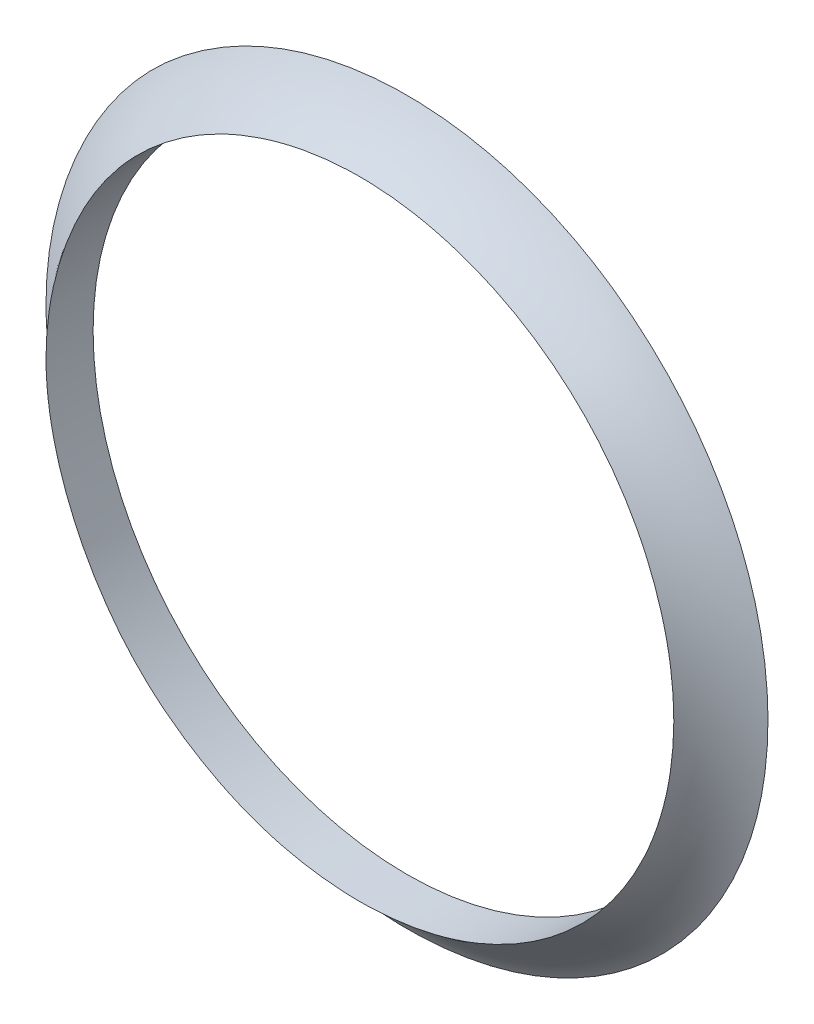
ISO-10303-21;
HEADER;
FILE_DESCRIPTION(('STEP AP214'),'2;1');
FILE_NAME('part.step','',(''),(''),'','','');
FILE_SCHEMA(('AUTOMOTIVE_DESIGN { 1 0 10303 214 1 1 1 1 }'));
ENDSEC;
DATA;
#1=APPLICATION_CONTEXT('core data for automotive mechanical design processes');
#2=APPLICATION_PROTOCOL_DEFINITION('international standard','automotive_design',2000,#1);
#3=PRODUCT_CONTEXT('',#1,'mechanical');
#4=PRODUCT('Part','Part','',(#3));
#5=PRODUCT_RELATED_PRODUCT_CATEGORY('part','',(#4));
#6=PRODUCT_DEFINITION_FORMATION('','',#4);
#7=PRODUCT_DEFINITION_CONTEXT('part definition',#1,'design');
#8=PRODUCT_DEFINITION('design','',#6,#7);
#9=PRODUCT_DEFINITION_SHAPE('','',#8);
#10=(LENGTH_UNIT() NAMED_UNIT(*) SI_UNIT(.MILLI.,.METRE.));
#11=(NAMED_UNIT(*) PLANE_ANGLE_UNIT() SI_UNIT($,.RADIAN.));
#12=(NAMED_UNIT(*) SI_UNIT($,.STERADIAN.) SOLID_ANGLE_UNIT());
#13=UNCERTAINTY_MEASURE_WITH_UNIT(LENGTH_MEASURE(1.E-05),#10,'distance_accuracy_value','');
#14=(GEOMETRIC_REPRESENTATION_CONTEXT(3) GLOBAL_UNCERTAINTY_ASSIGNED_CONTEXT((#13)) GLOBAL_UNIT_ASSIGNED_CONTEXT((#10,
#11,#12)) REPRESENTATION_CONTEXT('',''));
#15=CARTESIAN_POINT('',(0.,0.,0.));
#16=DIRECTION('',(0.,0.,1.));
#17=DIRECTION('',(1.,0.,0.));
#18=AXIS2_PLACEMENT_3D('',#15,#16,#17);
#19=CARTESIAN_POINT('',(274.208529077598,-309.466198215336,-163.999999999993));
#20=DIRECTION('',(0.,0.,1.));
#21=DIRECTION('',(-0.000437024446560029,-0.999999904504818,0.));
#22=AXIS2_PLACEMENT_3D('',#19,#20,#21);
#23=PLANE('',#22);
#24=CARTESIAN_POINT('',(301.151711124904,-439.488037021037,-163.999999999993));
#25=CARTESIAN_POINT('',(301.151703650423,-438.865242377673,-163.999999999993));
#26=CARTESIAN_POINT('',(301.179197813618,-438.242566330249,-163.999999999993));
#27=CARTESIAN_POINT('',(301.28687473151,-437.001589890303,-163.999999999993));
#28=CARTESIAN_POINT('',(301.367074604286,-436.383290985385,-163.999999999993));
#29=CARTESIAN_POINT('',(301.578055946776,-435.154078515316,-163.999999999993));
#30=CARTESIAN_POINT('',(301.70894633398,-434.543183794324,-163.999999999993));
#31=CARTESIAN_POINT('',(302.019060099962,-433.333816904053,-163.999999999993));
#32=CARTESIAN_POINT('',(302.198279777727,-432.735343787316,-163.999999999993));
#33=CARTESIAN_POINT('',(302.535109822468,-431.752433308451,-163.999999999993));
#34=CARTESIAN_POINT('',(302.679816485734,-431.363514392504,-163.999999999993));
#35=CARTESIAN_POINT('',(302.989157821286,-430.593662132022,-163.999999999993));
#36=CARTESIAN_POINT('',(303.153792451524,-430.212728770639,-163.999999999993));
#37=CARTESIAN_POINT('',(303.502498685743,-429.459868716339,-163.999999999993));
#38=CARTESIAN_POINT('',(303.686570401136,-429.087942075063,-163.999999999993));
#39=CARTESIAN_POINT('',(304.073497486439,-428.354520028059,-163.999999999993));
#40=CARTESIAN_POINT('',(304.276331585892,-427.993013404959,-163.999999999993));
#41=CARTESIAN_POINT('',(304.700560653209,-427.281051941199,-163.999999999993));
#42=CARTESIAN_POINT('',(304.921955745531,-426.930597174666,-163.999999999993));
#43=CARTESIAN_POINT('',(305.382957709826,-426.24181842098,-163.999999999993));
#44=CARTESIAN_POINT('',(305.62256652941,-425.90349573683,-163.999999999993));
#45=CARTESIAN_POINT('',(306.139840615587,-425.213220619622,-163.999999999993));
#46=CARTESIAN_POINT('',(306.419016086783,-424.86239830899,-163.999999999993));
#47=CARTESIAN_POINT('',(306.997777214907,-424.17795437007,-163.999999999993));
#48=CARTESIAN_POINT('',(307.297362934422,-423.844332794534,-163.999999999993));
#49=CARTESIAN_POINT('',(307.761612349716,-423.358210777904,-163.999999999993));
#50=CARTESIAN_POINT('',(307.918839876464,-423.198555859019,-163.999999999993));
#51=CARTESIAN_POINT('',(308.238159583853,-422.884187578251,-163.999999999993));
#52=CARTESIAN_POINT('',(308.400251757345,-422.729474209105,-163.999999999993));
#53=CARTESIAN_POINT('',(308.893672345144,-422.272760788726,-163.999999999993));
#54=CARTESIAN_POINT('',(309.232033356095,-421.978304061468,-163.999999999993));
#55=CARTESIAN_POINT('',(309.925855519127,-421.410188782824,-163.999999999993));
#56=CARTESIAN_POINT('',(310.281319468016,-421.136533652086,-163.999999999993));
#57=CARTESIAN_POINT('',(310.825976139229,-420.741972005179,-163.999999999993));
#58=CARTESIAN_POINT('',(311.009445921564,-420.613100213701,-163.999999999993));
#59=CARTESIAN_POINT('',(311.380034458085,-420.36063427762,-163.999999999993));
#60=CARTESIAN_POINT('',(311.567154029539,-420.237041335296,-163.999999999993));
#61=CARTESIAN_POINT('',(312.288617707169,-419.775213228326,-163.999999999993));
#62=CARTESIAN_POINT('',(312.835138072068,-419.455688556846,-163.999999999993));
#63=CARTESIAN_POINT('',(313.952388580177,-418.862296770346,-163.999999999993));
#64=CARTESIAN_POINT('',(314.523120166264,-418.588432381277,-163.999999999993));
#65=CARTESIAN_POINT('',(315.685130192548,-418.08908659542,-163.999999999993));
#66=CARTESIAN_POINT('',(316.276400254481,-417.863585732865,-163.999999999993));
#67=CARTESIAN_POINT('',(317.475923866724,-417.463057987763,-163.999999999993));
#68=CARTESIAN_POINT('',(318.084178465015,-417.288034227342,-163.999999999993));
#69=CARTESIAN_POINT('',(319.01147644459,-417.062840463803,-163.999999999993));
#70=CARTESIAN_POINT('',(319.325997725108,-416.993544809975,-163.999999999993));
#71=CARTESIAN_POINT('',(319.957706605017,-416.868315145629,-163.999999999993));
#72=CARTESIAN_POINT('',(320.274894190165,-416.812381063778,-163.999999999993));
#73=CARTESIAN_POINT('',(320.911319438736,-416.713741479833,-163.999999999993));
#74=CARTESIAN_POINT('',(321.23055715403,-416.671036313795,-163.999999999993));
#75=CARTESIAN_POINT('',(321.870526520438,-416.598841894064,-163.999999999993));
#76=CARTESIAN_POINT('',(322.191258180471,-416.569352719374,-163.999999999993));
#77=CARTESIAN_POINT('',(322.833781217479,-416.523648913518,-163.999999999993));
#78=CARTESIAN_POINT('',(323.155572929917,-416.507438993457,-163.999999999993));
#79=CARTESIAN_POINT('',(323.799550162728,-416.488516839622,-163.999999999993));
#80=CARTESIAN_POINT('',(324.121735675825,-416.485804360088,-163.999999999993));
#81=CARTESIAN_POINT('',(324.765935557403,-416.493986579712,-163.999999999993));
#82=CARTESIAN_POINT('',(325.087949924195,-416.504881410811,-163.999999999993));
#83=CARTESIAN_POINT('',(325.73125448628,-416.540021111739,-163.999999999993));
#84=CARTESIAN_POINT('',(326.052544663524,-416.564266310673,-163.999999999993));
#85=CARTESIAN_POINT('',(326.696978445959,-416.626316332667,-163.999999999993));
#86=CARTESIAN_POINT('',(327.02010954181,-416.664251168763,-163.999999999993));
#87=CARTESIAN_POINT('',(327.664496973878,-416.753613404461,-163.999999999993));
#88=CARTESIAN_POINT('',(327.985753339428,-416.805040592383,-163.999999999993));
#89=CARTESIAN_POINT('',(328.625777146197,-416.921499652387,-163.999999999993));
#90=CARTESIAN_POINT('',(328.944544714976,-416.98653082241,-163.999999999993));
#91=CARTESIAN_POINT('',(329.57898652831,-417.130274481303,-163.999999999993));
#92=CARTESIAN_POINT('',(329.894660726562,-417.208987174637,-163.999999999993));
#93=CARTESIAN_POINT('',(330.522212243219,-417.379937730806,-163.999999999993));
#94=CARTESIAN_POINT('',(330.834090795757,-417.472171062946,-163.999999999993));
#95=CARTESIAN_POINT('',(331.453581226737,-417.669998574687,-163.999999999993));
#96=CARTESIAN_POINT('',(331.761193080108,-417.77559283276,-163.999999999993));
#97=CARTESIAN_POINT('',(332.371585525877,-417.999874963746,-163.999999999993));
#98=CARTESIAN_POINT('',(332.67436645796,-418.118561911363,-163.999999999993));
#99=CARTESIAN_POINT('',(333.274668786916,-418.368710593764,-163.999999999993));
#100=CARTESIAN_POINT('',(333.572188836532,-418.500175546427,-163.999999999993));
#101=CARTESIAN_POINT('',(334.448983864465,-418.910037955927,-163.999999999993));
#102=CARTESIAN_POINT('',(335.019885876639,-419.206627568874,-163.999999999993));
#103=CARTESIAN_POINT('',(336.134835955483,-419.846446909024,-163.999999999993));
#104=CARTESIAN_POINT('',(336.67888373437,-420.189677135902,-163.999999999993));
#105=CARTESIAN_POINT('',(337.736528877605,-420.920580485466,-163.999999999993));
#106=CARTESIAN_POINT('',(338.250116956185,-421.308267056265,-163.999999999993));
#107=CARTESIAN_POINT('',(339.243217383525,-422.125090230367,-163.999999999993));
#108=CARTESIAN_POINT('',(339.722728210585,-422.554228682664,-163.999999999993));
#109=CARTESIAN_POINT('',(340.648626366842,-423.454866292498,-163.999999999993));
#110=CARTESIAN_POINT('',(341.094676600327,-423.926712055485,-163.999999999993));
#111=CARTESIAN_POINT('',(341.94559222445,-424.90617271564,-163.999999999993));
#112=CARTESIAN_POINT('',(342.350458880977,-425.413786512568,-163.999999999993));
#113=CARTESIAN_POINT('',(343.115801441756,-426.461193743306,-163.999999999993));
#114=CARTESIAN_POINT('',(343.476290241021,-427.000977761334,-163.999999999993));
#115=CARTESIAN_POINT('',(344.150487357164,-428.109147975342,-163.999999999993));
#116=CARTESIAN_POINT('',(344.464193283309,-428.677535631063,-163.999999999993));
#117=CARTESIAN_POINT('',(344.898076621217,-429.548664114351,-163.999999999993));
#118=CARTESIAN_POINT('',(345.036684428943,-429.842364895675,-163.999999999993));
#119=CARTESIAN_POINT('',(345.301358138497,-430.43538322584,-163.999999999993));
#120=CARTESIAN_POINT('',(345.427424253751,-430.734700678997,-163.999999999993));
#121=CARTESIAN_POINT('',(345.666682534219,-431.338410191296,-163.999999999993));
#122=CARTESIAN_POINT('',(345.779875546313,-431.642801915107,-163.999999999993));
#123=CARTESIAN_POINT('',(345.993084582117,-432.256169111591,-163.999999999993));
#124=CARTESIAN_POINT('',(346.093100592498,-432.565144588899,-163.999999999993));
#125=CARTESIAN_POINT('',(346.279740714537,-433.187172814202,-163.999999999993));
#126=CARTESIAN_POINT('',(346.366362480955,-433.500226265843,-163.999999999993));
#127=CARTESIAN_POINT('',(346.526046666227,-434.129810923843,-163.999999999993));
#128=CARTESIAN_POINT('',(346.59910752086,-434.446342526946,-163.999999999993));
#129=CARTESIAN_POINT('',(346.731585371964,-435.082263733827,-163.999999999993));
#130=CARTESIAN_POINT('',(346.791001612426,-435.401653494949,-163.999999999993));
#131=CARTESIAN_POINT('',(346.896327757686,-436.042614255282,-163.999999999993));
#132=CARTESIAN_POINT('',(346.942239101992,-436.364185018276,-163.999999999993));
#133=CARTESIAN_POINT('',(347.020153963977,-437.005182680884,-163.999999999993));
#134=CARTESIAN_POINT('',(347.052314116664,-437.324590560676,-163.999999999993));
#135=CARTESIAN_POINT('',(347.103450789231,-437.964455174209,-163.999999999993));
#136=CARTESIAN_POINT('',(347.122427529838,-438.284911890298,-163.999999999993));
#137=CARTESIAN_POINT('',(347.147047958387,-438.926336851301,-163.999999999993));
#138=CARTESIAN_POINT('',(347.152691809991,-439.247305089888,-163.999999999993));
#139=CARTESIAN_POINT('',(347.150448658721,-439.88919259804,-163.999999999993));
#140=CARTESIAN_POINT('',(347.142561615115,-440.210111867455,-163.999999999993));
#141=CARTESIAN_POINT('',(347.113498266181,-440.851302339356,-163.999999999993));
#142=CARTESIAN_POINT('',(347.092324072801,-441.171573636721,-163.999999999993));
#143=CARTESIAN_POINT('',(347.036811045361,-441.810944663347,-163.999999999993));
#144=CARTESIAN_POINT('',(347.002472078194,-442.13004438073,-163.999999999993));
#145=CARTESIAN_POINT('',(346.879764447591,-443.084840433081,-163.999999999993));
#146=CARTESIAN_POINT('',(346.771698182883,-443.718184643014,-163.999999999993));
#147=CARTESIAN_POINT('',(346.56862796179,-444.664393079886,-163.999999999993));
#148=CARTESIAN_POINT('',(346.493348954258,-444.981647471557,-163.999999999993));
#149=CARTESIAN_POINT('',(346.329138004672,-445.6125954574,-163.999999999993));
#150=CARTESIAN_POINT('',(346.240207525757,-445.926289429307,-163.999999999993));
#151=CARTESIAN_POINT('',(346.048853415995,-446.549560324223,-163.999999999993));
#152=CARTESIAN_POINT('',(345.946428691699,-446.859136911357,-163.999999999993));
#153=CARTESIAN_POINT('',(345.728342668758,-447.473569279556,-163.999999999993));
#154=CARTESIAN_POINT('',(345.612681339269,-447.778425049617,-163.999999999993));
#155=CARTESIAN_POINT('',(345.246346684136,-448.685146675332,-163.999999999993));
#156=CARTESIAN_POINT('',(344.97627871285,-449.27930965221,-163.999999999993));
#157=CARTESIAN_POINT('',(344.386802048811,-450.442522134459,-163.999999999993));
#158=CARTESIAN_POINT('',(344.067393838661,-451.011571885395,-163.999999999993));
#159=CARTESIAN_POINT('',(343.386808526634,-452.111844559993,-163.999999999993));
#160=CARTESIAN_POINT('',(343.026364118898,-452.643520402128,-163.999999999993));
#161=CARTESIAN_POINT('',(342.26237907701,-453.67493011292,-163.999999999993));
#162=CARTESIAN_POINT('',(341.858838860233,-454.174664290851,-163.999999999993));
#163=CARTESIAN_POINT('',(341.011619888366,-455.138964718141,-163.999999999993));
#164=CARTESIAN_POINT('',(340.567936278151,-455.603526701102,-163.999999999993));
#165=CARTESIAN_POINT('',(339.643599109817,-456.494281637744,-163.999999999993));
#166=CARTESIAN_POINT('',(339.162945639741,-456.920474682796,-163.999999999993));
#167=CARTESIAN_POINT('',(338.161360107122,-457.736674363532,-163.999999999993));
#168=CARTESIAN_POINT('',(337.639985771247,-458.126138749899,-163.999999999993));
#169=CARTESIAN_POINT('',(336.566138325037,-458.859535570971,-163.999999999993));
#170=CARTESIAN_POINT('',(336.013663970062,-459.203466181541,-163.999999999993));
#171=CARTESIAN_POINT('',(334.88166943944,-459.843345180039,-163.999999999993));
#172=CARTESIAN_POINT('',(334.302155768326,-460.139305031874,-163.999999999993));
#173=CARTESIAN_POINT('',(333.415849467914,-460.545603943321,-163.999999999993));
#174=CARTESIAN_POINT('',(333.11755071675,-460.674772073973,-163.999999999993));
#175=CARTESIAN_POINT('',(332.51570200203,-460.92031817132,-163.999999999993));
#176=CARTESIAN_POINT('',(332.21215193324,-461.036695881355,-163.999999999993));
#177=CARTESIAN_POINT('',(331.601813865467,-461.255779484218,-163.999999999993));
#178=CARTESIAN_POINT('',(331.295048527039,-461.358548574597,-163.999999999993));
#179=CARTESIAN_POINT('',(330.677418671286,-461.550820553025,-163.999999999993));
#180=CARTESIAN_POINT('',(330.366554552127,-461.640324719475,-163.999999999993));
#181=CARTESIAN_POINT('',(329.741244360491,-461.805916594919,-163.999999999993));
#182=CARTESIAN_POINT('',(329.426797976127,-461.882003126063,-163.999999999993));
#183=CARTESIAN_POINT('',(328.79493617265,-462.020640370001,-163.999999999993));
#184=CARTESIAN_POINT('',(328.477520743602,-462.083191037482,-163.999999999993));
#185=CARTESIAN_POINT('',(327.840285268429,-462.194873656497,-163.999999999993));
#186=CARTESIAN_POINT('',(327.520464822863,-462.244003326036,-163.999999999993));
#187=CARTESIAN_POINT('',(326.879057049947,-462.328919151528,-163.999999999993));
#188=CARTESIAN_POINT('',(326.557469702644,-462.364705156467,-163.999999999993));
#189=CARTESIAN_POINT('',(325.913083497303,-462.422896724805,-163.999999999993));
#190=CARTESIAN_POINT('',(325.590284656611,-462.445302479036,-163.999999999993));
#191=CARTESIAN_POINT('',(324.944066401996,-462.476623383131,-163.999999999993));
#192=CARTESIAN_POINT('',(324.620647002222,-462.48553883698,-163.999999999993));
#193=CARTESIAN_POINT('',(323.652302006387,-462.491643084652,-163.999999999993));
#194=CARTESIAN_POINT('',(323.007084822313,-462.468391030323,-163.999999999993));
#195=CARTESIAN_POINT('',(322.042624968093,-462.39361812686,-163.999999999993));
#196=CARTESIAN_POINT('',(321.721657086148,-462.362037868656,-163.999999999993));
#197=CARTESIAN_POINT('',(321.081272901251,-462.285627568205,-163.999999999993));
#198=CARTESIAN_POINT('',(320.761856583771,-462.240797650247,-163.999999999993));
#199=CARTESIAN_POINT('',(320.125169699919,-462.137855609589,-163.999999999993));
#200=CARTESIAN_POINT('',(319.80789918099,-462.079743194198,-163.999999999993));
#201=CARTESIAN_POINT('',(319.176105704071,-461.950091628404,-163.999999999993));
#202=CARTESIAN_POINT('',(318.86158277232,-461.878552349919,-163.999999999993));
#203=CARTESIAN_POINT('',(318.235927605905,-461.722091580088,-163.999999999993));
#204=CARTESIAN_POINT('',(317.924794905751,-461.637171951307,-163.999999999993));
#205=CARTESIAN_POINT('',(317.306454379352,-461.454067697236,-163.999999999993));
#206=CARTESIAN_POINT('',(316.99924667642,-461.355882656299,-163.999999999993));
#207=CARTESIAN_POINT('',(316.28727626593,-461.11139818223,-163.999999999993));
#208=CARTESIAN_POINT('',(315.884256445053,-460.959990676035,-163.999999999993));
#209=CARTESIAN_POINT('',(315.087426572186,-460.634556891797,-163.999999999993));
#210=CARTESIAN_POINT('',(314.69361744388,-460.460528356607,-163.999999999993));
#211=CARTESIAN_POINT('',(313.916330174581,-460.090673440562,-163.999999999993));
#212=CARTESIAN_POINT('',(313.532853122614,-459.894844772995,-163.999999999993));
#213=CARTESIAN_POINT('',(312.777456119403,-459.482286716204,-163.999999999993));
#214=CARTESIAN_POINT('',(312.405532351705,-459.265564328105,-163.999999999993));
#215=CARTESIAN_POINT('',(311.857061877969,-458.925415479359,-163.999999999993));
#216=CARTESIAN_POINT('',(311.675804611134,-458.809519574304,-163.999999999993));
#217=CARTESIAN_POINT('',(311.316531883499,-458.572807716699,-163.999999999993));
#218=CARTESIAN_POINT('',(311.138516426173,-458.451991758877,-163.999999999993));
#219=CARTESIAN_POINT('',(310.609609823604,-458.082231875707,-163.999999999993));
#220=CARTESIAN_POINT('',(310.263806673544,-457.825943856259,-163.999999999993));
#221=CARTESIAN_POINT('',(309.58514569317,-457.292278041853,-163.999999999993));
#222=CARTESIAN_POINT('',(309.252389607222,-457.014770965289,-163.999999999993));
#223=CARTESIAN_POINT('',(308.603760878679,-456.440667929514,-163.999999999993));
#224=CARTESIAN_POINT('',(308.287887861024,-456.14407239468,-163.999999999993));
#225=CARTESIAN_POINT('',(307.674483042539,-455.532518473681,-163.999999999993));
#226=CARTESIAN_POINT('',(307.376950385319,-455.217560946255,-163.999999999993));
#227=CARTESIAN_POINT('',(306.800675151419,-454.570783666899,-163.999999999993));
#228=CARTESIAN_POINT('',(306.521937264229,-454.238959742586,-163.999999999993));
#229=CARTESIAN_POINT('',(305.983710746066,-453.559994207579,-163.999999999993));
#230=CARTESIAN_POINT('',(305.724224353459,-453.212850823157,-163.999999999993));
#231=CARTESIAN_POINT('',(305.224959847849,-452.504696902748,-163.999999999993));
#232=CARTESIAN_POINT('',(304.985182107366,-452.143686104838,-163.999999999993));
#233=CARTESIAN_POINT('',(304.419866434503,-451.239803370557,-163.999999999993));
#234=CARTESIAN_POINT('',(304.105704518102,-450.689764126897,-163.999999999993));
#235=CARTESIAN_POINT('',(303.521742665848,-449.566711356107,-163.999999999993));
#236=CARTESIAN_POINT('',(303.251941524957,-448.993698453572,-163.999999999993));
#237=CARTESIAN_POINT('',(302.758387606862,-447.828477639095,-163.999999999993));
#238=CARTESIAN_POINT('',(302.534611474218,-447.236279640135,-163.999999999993));
#239=CARTESIAN_POINT('',(302.134874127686,-446.036138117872,-163.999999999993));
#240=CARTESIAN_POINT('',(301.958903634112,-445.42819767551,-163.999999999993));
#241=CARTESIAN_POINT('',(301.593670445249,-443.943167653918,-163.999999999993));
#242=CARTESIAN_POINT('',(301.429568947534,-443.059743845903,-163.999999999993));
#243=CARTESIAN_POINT('',(301.208645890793,-441.280135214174,-163.999999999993));
#244=CARTESIAN_POINT('',(301.15172187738,-440.383963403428,-163.999999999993));
#245=CARTESIAN_POINT('',(301.151711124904,-439.488037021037,-163.999999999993));
#246=B_SPLINE_CURVE_WITH_KNOTS('',3,(#24,#25,#26,#27,#28,#29,#30,#31,#32,#33,#34,#35,#36,#37,
#38,#39,#40,#41,#42,#43,#44,#45,#46,#47,#48,#49,#50,#51,#52,#53,#54,#55,#56,#57,#58,#59,#60,#61,
#62,#63,#64,#65,#66,#67,#68,#69,#70,#71,#72,#73,#74,#75,#76,#77,#78,#79,#80,#81,#82,#83,#84,#85,
#86,#87,#88,#89,#90,#91,#92,#93,#94,#95,#96,#97,#98,#99,#100,#101,#102,#103,#104,#105,#106,#107,
#108,#109,#110,#111,#112,#113,#114,#115,#116,#117,#118,#119,#120,#121,#122,#123,#124,#125,#126,
#127,#128,#129,#130,#131,#132,#133,#134,#135,#136,#137,#138,#139,#140,#141,#142,#143,#144,#145,
#146,#147,#148,#149,#150,#151,#152,#153,#154,#155,#156,#157,#158,#159,#160,#161,#162,#163,#164,
#165,#166,#167,#168,#169,#170,#171,#172,#173,#174,#175,#176,#177,#178,#179,#180,#181,#182,#183,
#184,#185,#186,#187,#188,#189,#190,#191,#192,#193,#194,#195,#196,#197,#198,#199,#200,#201,#202,
#203,#204,#205,#206,#207,#208,#209,#210,#211,#212,#213,#214,#215,#216,#217,#218,#219,#220,#221,
#222,#223,#224,#225,#226,#227,#228,#229,#230,#231,#232,#233,#234,#235,#236,#237,#238,#239,#240,
#241,#242,#243,#244,#245),.UNSPECIFIED.,.T.,.F.,(4,2,2,2,2,2,2,2,2,2,2,2,2,2,2,2,2,2,2,2,2,2,2,
2,2,2,2,2,2,2,2,2,2,2,2,2,2,2,2,2,2,2,2,2,2,2,2,2,2,2,2,2,2,2,2,2,2,2,2,2,2,2,2,2,2,2,2,2,2,2,2,
2,2,2,2,2,2,2,2,2,2,2,2,2,2,2,2,2,2,2,2,2,2,2,2,2,2,2,2,2,2,2,2,2,2,2,2,2,2,2,4),(0.,
1.86762920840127,3.73586529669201,5.60813809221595,7.48026755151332,8.72466558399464,
9.96906099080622,11.21346353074,12.4564722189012,13.6994892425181,14.9426393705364,
16.2869180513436,17.6312008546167,18.3033361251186,18.9754704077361,20.3202221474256,
21.6651945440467,22.337733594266,23.010425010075,24.9073292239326,26.8043466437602,
28.7005990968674,30.5969688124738,31.5629220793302,32.528870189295,33.4948428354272,
34.4608212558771,35.4271422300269,36.3934456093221,37.3597583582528,38.3260949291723,
39.3018615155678,40.277612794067,41.2533137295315,42.2290292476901,43.2044185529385,
44.1798135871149,45.1551397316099,46.1307121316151,48.058297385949,49.9859032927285,
51.9140938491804,53.8423704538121,55.7880081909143,57.7335861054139,59.6785973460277,
61.6237079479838,62.5977653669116,63.5718062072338,64.5457829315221,65.519760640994,
66.4939086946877,67.4681690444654,68.4424833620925,69.4166937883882,70.3794909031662,
71.3422718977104,72.3050410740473,73.2678131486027,74.2304322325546,75.1930610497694,
77.1178665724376,78.0958194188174,79.0736675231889,80.0515949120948,81.0295245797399,
82.9849371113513,84.9403305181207,86.8650925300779,88.7898359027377,90.7148123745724,
92.6397842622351,94.5897726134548,96.5398390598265,98.4894387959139,99.464391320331,
100.439363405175,101.409635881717,102.379814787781,103.350078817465,104.320346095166,
105.290778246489,106.261221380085,107.231650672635,108.202058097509,110.136251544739,
111.103604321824,112.070948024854,113.03831304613,114.005687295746,114.972927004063,
115.940197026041,117.231032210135,118.521996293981,119.813095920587,121.103764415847,
121.749120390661,122.394477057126,123.685007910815,124.984147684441,126.283258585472,
127.582308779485,128.88168190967,130.181205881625,131.480754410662,133.378949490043,
135.277092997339,137.174270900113,139.071080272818,141.760345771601,144.447039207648),.UNSPECIFIED.);
#247=CARTESIAN_POINT('',(301.151711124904,-439.488037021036,-163.999999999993));
#248=VERTEX_POINT('',#247);
#249=EDGE_CURVE('E61',#248,#248,#246,.T.);
#250=ORIENTED_EDGE('',*,*,#249,.T.);
#251=EDGE_LOOP('',(#250));
#252=FACE_BOUND('',#251,.T.);
#253=CARTESIAN_POINT('',(324.151711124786,-439.488037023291,-163.999999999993));
#254=DIRECTION('',(0.,0.,1.));
#255=DIRECTION('',(-0.000437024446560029,-0.999999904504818,0.));
#256=AXIS2_PLACEMENT_3D('',#253,#254,#255);
#257=CIRCLE('',#256,20.);
#258=CARTESIAN_POINT('',(324.142970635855,-459.488035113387,-163.999999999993));
#259=VERTEX_POINT('',#258);
#260=EDGE_CURVE('E71',#259,#259,#257,.T.);
#261=ORIENTED_EDGE('',*,*,#260,.T.);
#262=EDGE_LOOP('',(#261));
#263=FACE_BOUND('',#262,.T.);
#264=ADVANCED_FACE('F54',(#252,#263),#23,.F.);
#265=CARTESIAN_POINT('',(324.15171112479,-439.48803702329,-152.499999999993));
#266=DIRECTION('',(0.,0.,-1.));
#267=DIRECTION('',(0.000437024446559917,0.999999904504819,0.));
#268=AXIS2_PLACEMENT_3D('',#265,#266,#267);
#269=CYLINDRICAL_SURFACE('',#268,20.);
#270=CARTESIAN_POINT('',(304.15171112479,-439.488037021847,-160.999999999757));
#271=CARTESIAN_POINT('',(304.15171486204,-440.048969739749,-160.999998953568));
#272=CARTESIAN_POINT('',(304.175330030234,-440.610006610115,-161.003315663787));
#273=CARTESIAN_POINT('',(304.269639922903,-441.728176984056,-161.013238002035));
#274=CARTESIAN_POINT('',(304.340347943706,-442.285309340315,-161.019844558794));
#275=CARTESIAN_POINT('',(304.528447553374,-443.392272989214,-161.033482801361));
#276=CARTESIAN_POINT('',(304.645891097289,-443.942095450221,-161.040514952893));
#277=CARTESIAN_POINT('',(304.926651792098,-445.029926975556,-161.052818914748));
#278=CARTESIAN_POINT('',(305.089965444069,-445.567936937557,-161.058090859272));
#279=CARTESIAN_POINT('',(305.399410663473,-446.45163358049,-161.064283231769));
#280=CARTESIAN_POINT('',(305.533155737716,-446.80170735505,-161.066068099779));
#281=CARTESIAN_POINT('',(305.820108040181,-447.493824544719,-161.068065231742));
#282=CARTESIAN_POINT('',(305.973315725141,-447.835867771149,-161.068277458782));
#283=CARTESIAN_POINT('',(306.298696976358,-448.510799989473,-161.067093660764));
#284=CARTESIAN_POINT('',(306.470870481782,-448.843689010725,-161.065697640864));
#285=CARTESIAN_POINT('',(306.833599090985,-449.499194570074,-161.06144087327));
#286=CARTESIAN_POINT('',(307.024150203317,-449.821813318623,-161.058580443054));
#287=CARTESIAN_POINT('',(307.423061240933,-450.455833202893,-161.051716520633));
#288=CARTESIAN_POINT('',(307.631421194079,-450.767234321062,-161.047713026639));
#289=CARTESIAN_POINT('',(308.06529368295,-451.377841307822,-161.039071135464));
#290=CARTESIAN_POINT('',(308.290806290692,-451.6770471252,-161.034432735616));
#291=CARTESIAN_POINT('',(308.758083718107,-452.262083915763,-161.025225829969));
#292=CARTESIAN_POINT('',(308.999834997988,-452.547925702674,-161.020657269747));
#293=CARTESIAN_POINT('',(309.49899959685,-453.105602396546,-161.01247492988));
#294=CARTESIAN_POINT('',(309.756412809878,-453.377437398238,-161.008861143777));
#295=CARTESIAN_POINT('',(310.286094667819,-453.906245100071,-161.003670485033));
#296=CARTESIAN_POINT('',(310.558363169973,-454.163217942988,-161.00209359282));
#297=CARTESIAN_POINT('',(311.116893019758,-454.661487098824,-161.000429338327));
#298=CARTESIAN_POINT('',(311.403154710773,-454.902783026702,-161.000342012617));
#299=CARTESIAN_POINT('',(311.988785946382,-455.368947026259,-161.000853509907));
#300=CARTESIAN_POINT('',(312.288155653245,-455.593814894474,-161.001452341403));
#301=CARTESIAN_POINT('',(312.74628283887,-455.91822974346,-161.002099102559));
#302=CARTESIAN_POINT('',(312.900510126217,-456.0242240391,-161.00227277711));
#303=CARTESIAN_POINT('',(313.211880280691,-456.231845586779,-161.002417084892));
#304=CARTESIAN_POINT('',(313.369023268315,-456.333472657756,-161.002387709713));
#305=CARTESIAN_POINT('',(314.003538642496,-456.731298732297,-161.001923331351));
#306=CARTESIAN_POINT('',(314.492226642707,-457.009740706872,-161.000794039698));
#307=CARTESIAN_POINT('',(315.491289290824,-457.524469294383,-160.997886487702));
#308=CARTESIAN_POINT('',(316.001663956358,-457.760755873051,-160.99610822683));
#309=CARTESIAN_POINT('',(316.780672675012,-458.082304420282,-160.993989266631));
#310=CARTESIAN_POINT('',(317.042613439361,-458.184016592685,-160.993374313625));
#311=CARTESIAN_POINT('',(317.570547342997,-458.376319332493,-160.992469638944));
#312=CARTESIAN_POINT('',(317.836540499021,-458.466909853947,-160.992179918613));
#313=CARTESIAN_POINT('',(318.639862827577,-458.721732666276,-160.991914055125));
#314=CARTESIAN_POINT('',(319.1826513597,-458.869064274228,-160.992540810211));
#315=CARTESIAN_POINT('',(320.279033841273,-459.117568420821,-160.99499676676));
#316=CARTESIAN_POINT('',(320.832634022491,-459.2187134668,-160.99682668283));
#317=CARTESIAN_POINT('',(321.667815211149,-459.335186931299,-160.998724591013));
#318=CARTESIAN_POINT('',(321.947037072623,-459.368139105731,-160.999216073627));
#319=CARTESIAN_POINT('',(322.506639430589,-459.422247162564,-160.999874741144));
#320=CARTESIAN_POINT('',(322.787019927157,-459.443403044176,-161.000041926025));
#321=CARTESIAN_POINT('',(323.348418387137,-459.47387586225,-161.000130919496));
#322=CARTESIAN_POINT('',(323.62943634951,-459.48319281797,-161.000052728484));
#323=CARTESIAN_POINT('',(324.191616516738,-459.489972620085,-161.00000100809));
#324=CARTESIAN_POINT('',(324.472778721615,-459.487435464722,-161.000027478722));
#325=CARTESIAN_POINT('',(325.034746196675,-459.470511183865,-161.000030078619));
#326=CARTESIAN_POINT('',(325.315551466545,-459.456124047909,-161.000006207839));
#327=CARTESIAN_POINT('',(325.876305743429,-459.41552548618,-160.999667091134));
#328=CARTESIAN_POINT('',(326.156254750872,-459.389314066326,-160.999351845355));
#329=CARTESIAN_POINT('',(326.714809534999,-459.325112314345,-160.998418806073));
#330=CARTESIAN_POINT('',(326.993415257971,-459.287121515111,-160.997801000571));
#331=CARTESIAN_POINT('',(327.54877721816,-459.199428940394,-160.996398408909));
#332=CARTESIAN_POINT('',(327.825533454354,-459.149727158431,-160.995613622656));
#333=CARTESIAN_POINT('',(328.37670476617,-459.038700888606,-160.994240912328));
#334=CARTESIAN_POINT('',(328.651119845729,-458.977376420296,-160.993652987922));
#335=CARTESIAN_POINT('',(329.197121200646,-458.843213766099,-160.992813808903));
#336=CARTESIAN_POINT('',(329.46870747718,-458.770375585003,-160.99256255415));
#337=CARTESIAN_POINT('',(330.008568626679,-458.613314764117,-160.992411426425));
#338=CARTESIAN_POINT('',(330.276843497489,-458.52909211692,-160.992511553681));
#339=CARTESIAN_POINT('',(330.809602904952,-458.349413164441,-160.993014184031));
#340=CARTESIAN_POINT('',(331.074087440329,-458.253956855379,-160.993416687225));
#341=CARTESIAN_POINT('',(331.598801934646,-458.051976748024,-160.994384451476));
#342=CARTESIAN_POINT('',(331.859031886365,-457.945452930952,-160.994949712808));
#343=CARTESIAN_POINT('',(332.374753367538,-457.721540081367,-160.996079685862));
#344=CARTESIAN_POINT('',(332.630244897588,-457.604151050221,-160.996644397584));
#345=CARTESIAN_POINT('',(333.38893819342,-457.235980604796,-160.998304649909));
#346=CARTESIAN_POINT('',(333.884473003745,-456.969151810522,-160.999366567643));
#347=CARTESIAN_POINT('',(334.851235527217,-456.394735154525,-161.001365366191));
#348=CARTESIAN_POINT('',(335.322463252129,-456.087147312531,-161.002302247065));
#349=CARTESIAN_POINT('',(336.237351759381,-455.433360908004,-161.004074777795));
#350=CARTESIAN_POINT('',(336.681012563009,-455.087162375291,-161.004910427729));
#351=CARTESIAN_POINT('',(337.537590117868,-454.358624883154,-161.006077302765));
#352=CARTESIAN_POINT('',(337.950506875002,-453.976285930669,-161.006408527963));
#353=CARTESIAN_POINT('',(338.742683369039,-453.178167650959,-161.006349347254));
#354=CARTESIAN_POINT('',(339.121941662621,-452.762386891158,-161.005958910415));
#355=CARTESIAN_POINT('',(339.844085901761,-451.900349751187,-161.004707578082));
#356=CARTESIAN_POINT('',(340.186971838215,-451.45409336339,-161.003846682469));
#357=CARTESIAN_POINT('',(340.833924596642,-450.534300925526,-161.002047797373));
#358=CARTESIAN_POINT('',(341.137991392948,-450.060764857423,-161.001109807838));
#359=CARTESIAN_POINT('',(341.705181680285,-449.089689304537,-160.999095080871));
#360=CARTESIAN_POINT('',(341.968305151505,-448.59214980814,-160.998018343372));
#361=CARTESIAN_POINT('',(342.330801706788,-447.830686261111,-160.996344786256));
#362=CARTESIAN_POINT('',(342.446280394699,-447.57430940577,-160.995777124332));
#363=CARTESIAN_POINT('',(342.666336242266,-447.056898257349,-160.994655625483));
#364=CARTESIAN_POINT('',(342.77091340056,-446.795863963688,-160.994101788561));
#365=CARTESIAN_POINT('',(342.968967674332,-446.269622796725,-160.993191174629));
#366=CARTESIAN_POINT('',(343.062444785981,-446.004415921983,-160.992834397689));
#367=CARTESIAN_POINT('',(343.238135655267,-445.470296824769,-160.992438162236));
#368=CARTESIAN_POINT('',(343.320349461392,-445.201384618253,-160.992398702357));
#369=CARTESIAN_POINT('',(343.473367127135,-444.660333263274,-160.992672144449));
#370=CARTESIAN_POINT('',(343.544170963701,-444.388194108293,-160.992985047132));
#371=CARTESIAN_POINT('',(343.674242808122,-443.841173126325,-160.993945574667));
#372=CARTESIAN_POINT('',(343.733510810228,-443.566291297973,-160.994593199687));
#373=CARTESIAN_POINT('',(343.840405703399,-443.014273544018,-160.996023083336));
#374=CARTESIAN_POINT('',(343.888032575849,-442.737137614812,-160.996805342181));
#375=CARTESIAN_POINT('',(343.97156053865,-442.181103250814,-160.998161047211));
#376=CARTESIAN_POINT('',(344.007461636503,-441.90220481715,-160.99873449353));
#377=CARTESIAN_POINT('',(344.067472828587,-441.343156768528,-160.999565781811));
#378=CARTESIAN_POINT('',(344.091583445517,-441.063007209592,-160.999823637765));
#379=CARTESIAN_POINT('',(344.127973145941,-440.501931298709,-161.00007416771));
#380=CARTESIAN_POINT('',(344.140252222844,-440.221004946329,-161.000066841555));
#381=CARTESIAN_POINT('',(344.149780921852,-439.799432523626,-161.000022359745));
#382=CARTESIAN_POINT('',(344.151475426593,-439.658874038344,-161.000001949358));
#383=CARTESIAN_POINT('',(344.15190099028,-439.377752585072,-160.999998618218));
#384=CARTESIAN_POINT('',(344.150632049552,-439.237189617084,-161.00001569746));
#385=CARTESIAN_POINT('',(344.142379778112,-438.815590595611,-161.000060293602));
#386=CARTESIAN_POINT('',(344.13095135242,-438.534628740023,-161.000081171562));
#387=CARTESIAN_POINT('',(344.096260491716,-437.973445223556,-160.999866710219));
#388=CARTESIAN_POINT('',(344.07299805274,-437.693223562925,-160.999631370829));
#389=CARTESIAN_POINT('',(344.01468139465,-437.13400977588,-160.998843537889));
#390=CARTESIAN_POINT('',(343.979627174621,-436.855017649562,-160.998291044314));
#391=CARTESIAN_POINT('',(343.89778643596,-436.298753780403,-160.996963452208));
#392=CARTESIAN_POINT('',(343.850999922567,-436.021482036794,-160.996188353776));
#393=CARTESIAN_POINT('',(343.745788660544,-435.469182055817,-160.994742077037));
#394=CARTESIAN_POINT('',(343.687363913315,-435.194153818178,-160.994070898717));
#395=CARTESIAN_POINT('',(343.494754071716,-434.373107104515,-160.992569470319));
#396=CARTESIAN_POINT('',(343.343215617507,-433.831005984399,-160.992250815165));
#397=CARTESIAN_POINT('',(343.082139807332,-433.02908778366,-160.992768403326));
#398=CARTESIAN_POINT('',(342.989474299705,-432.763624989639,-160.993106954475));
#399=CARTESIAN_POINT('',(342.793037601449,-432.236833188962,-160.993992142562));
#400=CARTESIAN_POINT('',(342.689266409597,-431.975504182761,-160.994538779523));
#401=CARTESIAN_POINT('',(342.361564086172,-431.198454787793,-160.99620847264));
#402=CARTESIAN_POINT('',(342.121205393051,-430.689552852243,-160.997361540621));
#403=CARTESIAN_POINT('',(341.598503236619,-429.693870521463,-160.999503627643));
#404=CARTESIAN_POINT('',(341.316159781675,-429.207090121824,-161.000492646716));
#405=CARTESIAN_POINT('',(340.711471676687,-428.259039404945,-161.002415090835));
#406=CARTESIAN_POINT('',(340.389128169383,-427.797768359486,-161.003348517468));
#407=CARTESIAN_POINT('',(339.706733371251,-426.904022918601,-161.004972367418));
#408=CARTESIAN_POINT('',(339.34668208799,-426.471548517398,-161.005662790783));
#409=CARTESIAN_POINT('',(338.591428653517,-425.638464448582,-161.006413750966));
#410=CARTESIAN_POINT('',(338.1962265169,-425.237854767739,-161.006474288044));
#411=CARTESIAN_POINT('',(337.373481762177,-424.47134985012,-161.00592407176));
#412=CARTESIAN_POINT('',(336.945939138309,-424.10545461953,-161.005313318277));
#413=CARTESIAN_POINT('',(336.061535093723,-423.410965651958,-161.00377824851));
#414=CARTESIAN_POINT('',(335.604672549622,-423.082373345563,-161.002853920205));
#415=CARTESIAN_POINT('',(334.6648925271,-422.464842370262,-161.000960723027));
#416=CARTESIAN_POINT('',(334.181975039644,-422.175903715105,-160.99999185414));
#417=CARTESIAN_POINT('',(333.193512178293,-421.639733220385,-160.997897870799));
#418=CARTESIAN_POINT('',(332.687966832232,-421.39250132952,-160.996772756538));
#419=CARTESIAN_POINT('',(331.657867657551,-420.941506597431,-160.994500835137));
#420=CARTESIAN_POINT('',(331.133313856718,-420.737743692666,-160.99335402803));
#421=CARTESIAN_POINT('',(330.068806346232,-420.375108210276,-160.992285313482));
#422=CARTESIAN_POINT('',(329.528852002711,-420.216237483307,-160.992363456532));
#423=CARTESIAN_POINT('',(328.710475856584,-420.012493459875,-160.993536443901));
#424=CARTESIAN_POINT('',(328.436245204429,-419.950334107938,-160.994103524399));
#425=CARTESIAN_POINT('',(327.88538912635,-419.837625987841,-160.995453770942));
#426=CARTESIAN_POINT('',(327.608763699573,-419.787077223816,-160.996236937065));
#427=CARTESIAN_POINT('',(327.053631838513,-419.697688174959,-160.9976573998));
#428=CARTESIAN_POINT('',(326.775125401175,-419.658847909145,-160.998294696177));
#429=CARTESIAN_POINT('',(326.216720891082,-419.592942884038,-160.999269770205));
#430=CARTESIAN_POINT('',(325.936822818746,-419.565878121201,-160.999607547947));
#431=CARTESIAN_POINT('',(325.37613499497,-419.52357290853,-160.999987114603));
#432=CARTESIAN_POINT('',(325.095345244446,-419.508332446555,-161.000028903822));
#433=CARTESIAN_POINT('',(324.533372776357,-419.489702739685,-161.000032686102));
#434=CARTESIAN_POINT('',(324.252190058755,-419.486313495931,-160.999994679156));
#435=CARTESIAN_POINT('',(323.68994497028,-419.491392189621,-161.000041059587));
#436=CARTESIAN_POINT('',(323.408882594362,-419.499859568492,-161.000125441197));
#437=CARTESIAN_POINT('',(322.84736459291,-419.528635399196,-161.0000652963));
#438=CARTESIAN_POINT('',(322.566908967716,-419.548943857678,-160.999920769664));
#439=CARTESIAN_POINT('',(322.007102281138,-419.601365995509,-160.999306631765));
#440=CARTESIAN_POINT('',(321.727751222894,-419.633479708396,-160.998837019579));
#441=CARTESIAN_POINT('',(321.170654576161,-419.709454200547,-160.997613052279));
#442=CARTESIAN_POINT('',(320.892908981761,-419.753314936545,-160.996858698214));
#443=CARTESIAN_POINT('',(320.339507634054,-419.85270857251,-160.995323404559));
#444=CARTESIAN_POINT('',(320.063851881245,-419.908241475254,-160.994542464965));
#445=CARTESIAN_POINT('',(319.515144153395,-420.030870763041,-160.993262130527));
#446=CARTESIAN_POINT('',(319.242092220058,-420.097967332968,-160.992762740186));
#447=CARTESIAN_POINT('',(318.427542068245,-420.31645077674,-160.991836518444));
#448=CARTESIAN_POINT('',(317.89052022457,-420.485054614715,-160.991981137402));
#449=CARTESIAN_POINT('',(317.009081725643,-420.80318929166,-160.993396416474));
#450=CARTESIAN_POINT('',(316.660114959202,-420.940353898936,-160.994275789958));
#451=CARTESIAN_POINT('',(315.970405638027,-421.234087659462,-160.996276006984));
#452=CARTESIAN_POINT('',(315.629663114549,-421.390656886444,-160.997396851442));
#453=CARTESIAN_POINT('',(314.957529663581,-421.722689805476,-160.999468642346));
#454=CARTESIAN_POINT('',(314.62613869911,-421.898153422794,-161.000419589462));
#455=CARTESIAN_POINT('',(313.973734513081,-422.267431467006,-161.001827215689));
#456=CARTESIAN_POINT('',(313.652720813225,-422.461245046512,-161.002283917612));
#457=CARTESIAN_POINT('',(313.179783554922,-422.765239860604,-161.002408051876));
#458=CARTESIAN_POINT('',(313.023560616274,-422.868789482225,-161.002355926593));
#459=CARTESIAN_POINT('',(312.714086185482,-423.080238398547,-161.002074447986));
#460=CARTESIAN_POINT('',(312.560834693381,-423.188137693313,-161.001845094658));
#461=CARTESIAN_POINT('',(312.105729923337,-423.51822838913,-161.001119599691));
#462=CARTESIAN_POINT('',(311.808494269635,-423.746833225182,-161.000585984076));
#463=CARTESIAN_POINT('',(311.227338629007,-424.220388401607,-161.000388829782));
#464=CARTESIAN_POINT('',(310.943418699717,-424.465338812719,-161.000725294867));
#465=CARTESIAN_POINT('',(310.528226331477,-424.844410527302,-161.00244003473));
#466=CARTESIAN_POINT('',(310.391603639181,-424.97271541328,-161.003213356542));
#467=CARTESIAN_POINT('',(310.122020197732,-425.233111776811,-161.005248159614));
#468=CARTESIAN_POINT('',(309.989059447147,-425.365203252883,-161.006509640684));
#469=CARTESIAN_POINT('',(309.595833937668,-425.766999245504,-161.010987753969));
#470=CARTESIAN_POINT('',(309.341199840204,-426.042249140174,-161.014898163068));
#471=CARTESIAN_POINT('',(308.847762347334,-426.60666601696,-161.023464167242));
#472=CARTESIAN_POINT('',(308.608962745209,-426.895836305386,-161.028119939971));
#473=CARTESIAN_POINT('',(308.147988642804,-427.487145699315,-161.037337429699));
#474=CARTESIAN_POINT('',(307.925814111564,-427.789284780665,-161.041899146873));
#475=CARTESIAN_POINT('',(307.498797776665,-428.405572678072,-161.050262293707));
#476=CARTESIAN_POINT('',(307.293955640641,-428.719721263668,-161.054063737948));
#477=CARTESIAN_POINT('',(306.902273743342,-429.35899900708,-161.060437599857));
#478=CARTESIAN_POINT('',(306.715431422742,-429.68412659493,-161.063010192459));
#479=CARTESIAN_POINT('',(306.360305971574,-430.344382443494,-161.066643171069));
#480=CARTESIAN_POINT('',(306.192023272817,-430.67951093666,-161.0677035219));
#481=CARTESIAN_POINT('',(305.874547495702,-431.358718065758,-161.068207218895));
#482=CARTESIAN_POINT('',(305.725355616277,-431.702797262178,-161.067650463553));
#483=CARTESIAN_POINT('',(305.446698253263,-432.398416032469,-161.064989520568));
#484=CARTESIAN_POINT('',(305.317211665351,-432.74994715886,-161.062887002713));
#485=CARTESIAN_POINT('',(305.078189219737,-433.459689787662,-161.057373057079));
#486=CARTESIAN_POINT('',(304.968651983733,-433.81790082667,-161.053961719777));
#487=CARTESIAN_POINT('',(304.76988757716,-434.539801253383,-161.046231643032));
#488=CARTESIAN_POINT('',(304.68065487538,-434.903489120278,-161.041913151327));
#489=CARTESIAN_POINT('',(304.526988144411,-435.615608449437,-161.033170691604));
#490=CARTESIAN_POINT('',(304.461478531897,-435.963808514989,-161.028764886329));
#491=CARTESIAN_POINT('',(304.349032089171,-436.663255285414,-161.020241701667));
#492=CARTESIAN_POINT('',(304.302098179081,-437.014502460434,-161.016124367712));
#493=CARTESIAN_POINT('',(304.22695864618,-437.718947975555,-161.008887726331));
#494=CARTESIAN_POINT('',(304.198749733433,-438.072145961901,-161.005768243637));
#495=CARTESIAN_POINT('',(304.161124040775,-438.77956107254,-161.001324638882));
#496=CARTESIAN_POINT('',(304.151708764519,-439.133778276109,-161.000000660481));
#497=CARTESIAN_POINT('',(304.15171112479,-439.488037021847,-160.999999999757));
#498=B_SPLINE_CURVE_WITH_KNOTS('',3,(#270,#271,#272,#273,#274,#275,#276,#277,#278,#279,#280,
#281,#282,#283,#284,#285,#286,#287,#288,#289,#290,#291,#292,#293,#294,#295,#296,#297,#298,#299,
#300,#301,#302,#303,#304,#305,#306,#307,#308,#309,#310,#311,#312,#313,#314,#315,#316,#317,#318,
#319,#320,#321,#322,#323,#324,#325,#326,#327,#328,#329,#330,#331,#332,#333,#334,#335,#336,#337,
#338,#339,#340,#341,#342,#343,#344,#345,#346,#347,#348,#349,#350,#351,#352,#353,#354,#355,#356,
#357,#358,#359,#360,#361,#362,#363,#364,#365,#366,#367,#368,#369,#370,#371,#372,#373,#374,#375,
#376,#377,#378,#379,#380,#381,#382,#383,#384,#385,#386,#387,#388,#389,#390,#391,#392,#393,#394,
#395,#396,#397,#398,#399,#400,#401,#402,#403,#404,#405,#406,#407,#408,#409,#410,#411,#412,#413,
#414,#415,#416,#417,#418,#419,#420,#421,#422,#423,#424,#425,#426,#427,#428,#429,#430,#431,#432,
#433,#434,#435,#436,#437,#438,#439,#440,#441,#442,#443,#444,#445,#446,#447,#448,#449,#450,#451,
#452,#453,#454,#455,#456,#457,#458,#459,#460,#461,#462,#463,#464,#465,#466,#467,#468,#469,#470,
#471,#472,#473,#474,#475,#476,#477,#478,#479,#480,#481,#482,#483,#484,#485,#486,#487,#488,#489,
#490,#491,#492,#493,#494,#495,#496,#497),.UNSPECIFIED.,.T.,.F.,(4,2,2,2,2,2,2,2,2,2,2,2,2,2,2,2,
2,2,2,2,2,2,2,2,2,2,2,2,2,2,2,2,2,2,2,2,2,2,2,2,2,2,2,2,2,2,2,2,2,2,2,2,2,2,2,2,2,2,2,2,2,2,2,2,
2,2,2,2,2,2,2,2,2,2,2,2,2,2,2,2,2,2,2,2,2,2,2,2,2,2,2,2,2,2,2,2,2,2,2,2,2,2,2,2,2,2,2,2,2,2,2,2,
2,4),(0.,1.6824851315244,3.36544550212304,5.05028203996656,6.73499009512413,7.85871906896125,
8.98247441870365,10.1062261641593,11.229734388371,12.353244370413,13.4767590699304,
14.5993483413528,15.7219300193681,16.844500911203,17.9670993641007,19.0897117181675,
19.6510611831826,20.2124338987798,21.8975910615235,23.5827495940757,24.4255175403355,
25.268288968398,26.9534549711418,28.6396227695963,29.4828942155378,30.3261657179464,
31.1694358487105,32.0127061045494,32.8559771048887,33.6992476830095,34.542551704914,
35.3858561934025,36.2291592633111,37.0724619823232,37.9157652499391,38.7590688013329,
39.6023737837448,40.4456786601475,42.1319220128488,43.8181645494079,45.5044057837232,
47.1906466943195,48.8769598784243,50.5632734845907,52.2495882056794,53.9359037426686,
54.7792529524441,55.6226022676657,56.4659518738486,57.309297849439,58.1526455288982,
58.9959936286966,59.8393430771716,60.6826919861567,61.5260035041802,62.3693154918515,
62.7909946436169,63.2126737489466,64.0559849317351,64.8992963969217,65.7426079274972,
66.5859190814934,67.4292301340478,69.115487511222,69.9588042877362,70.802121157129,
72.4883801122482,74.1746387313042,75.8608491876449,77.5470593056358,79.233268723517,
80.9194784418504,82.6057528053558,84.2920277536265,85.9783006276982,87.6645710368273,
89.3509109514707,90.1942697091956,91.0376287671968,91.8809891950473,92.724349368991,
93.567708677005,94.4110680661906,95.2543877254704,96.0977078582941,96.9410303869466,
97.7843498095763,98.6276694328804,99.4710025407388,101.157275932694,102.28163640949,
103.406001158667,104.530361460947,105.654669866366,106.216881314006,106.779092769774,
107.903401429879,109.027714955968,109.589927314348,110.152139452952,111.276457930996,
112.401044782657,113.525629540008,114.650192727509,115.774595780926,116.899024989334,
118.023524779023,119.146811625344,120.270020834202,121.392923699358,122.455437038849,
123.518117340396,124.58061088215,125.64318942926),.UNSPECIFIED.);
#499=CARTESIAN_POINT('',(304.15171112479,-439.488037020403,-160.999999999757));
#500=VERTEX_POINT('',#499);
#501=EDGE_CURVE('E11',#500,#500,#498,.T.);
#502=ORIENTED_EDGE('',*,*,#501,.T.);
#503=EDGE_LOOP('',(#502));
#504=FACE_BOUND('',#503,.T.);
#505=ORIENTED_EDGE('',*,*,#260,.F.);
#506=EDGE_LOOP('',(#505));
#507=FACE_BOUND('',#506,.T.);
#508=ADVANCED_FACE('F75',(#504,#507),#269,.F.);
#509=CARTESIAN_POINT('',(304.173915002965,-439.488037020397,-160.963847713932));
#510=CARTESIAN_POINT('',(304.173915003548,-434.249690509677,-160.963847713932));
#511=CARTESIAN_POINT('',(306.972050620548,-427.701757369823,-160.963847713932));
#512=CARTESIAN_POINT('',(312.9119002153,-422.828062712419,-160.963847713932));
#513=CARTESIAN_POINT('',(316.321664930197,-420.967260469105,-160.963847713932));
#514=CARTESIAN_POINT('',(320.073142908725,-419.790235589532,-160.963847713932));
#515=CARTESIAN_POINT('',(324.151710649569,-419.370303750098,-160.963847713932));
#516=CARTESIAN_POINT('',(328.230281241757,-419.789994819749,-160.963847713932));
#517=CARTESIAN_POINT('',(331.981750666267,-420.968223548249,-160.963847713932));
#518=CARTESIAN_POINT('',(335.391546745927,-422.824451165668,-160.963847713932));
#519=CARTESIAN_POINT('',(338.361354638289,-425.278393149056,-160.963847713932));
#520=CARTESIAN_POINT('',(340.81529832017,-428.248201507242,-160.963847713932));
#521=CARTESIAN_POINT('',(342.67151960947,-431.65799742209,-160.963847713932));
#522=CARTESIAN_POINT('',(343.849771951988,-435.409467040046,-160.963847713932));
#523=CARTESIAN_POINT('',(344.26937489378,-439.488037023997,-160.963847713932));
#524=CARTESIAN_POINT('',(343.8497719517,-443.566607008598,-160.963847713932));
#525=CARTESIAN_POINT('',(342.671519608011,-447.318076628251,-160.963847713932));
#526=CARTESIAN_POINT('',(340.815298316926,-450.727872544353,-160.963847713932));
#527=CARTESIAN_POINT('',(338.361354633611,-453.697680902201,-160.963847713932));
#528=CARTESIAN_POINT('',(335.39154674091,-456.151622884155,-160.963847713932));
#529=CARTESIAN_POINT('',(331.981750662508,-458.007850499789,-160.963847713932));
#530=CARTESIAN_POINT('',(328.230281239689,-459.186079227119,-160.963847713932));
#531=CARTESIAN_POINT('',(324.151710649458,-459.605770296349,-160.963847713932));
#532=CARTESIAN_POINT('',(320.073142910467,-459.185838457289,-160.963847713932));
#533=CARTESIAN_POINT('',(316.321664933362,-458.0088135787,-160.963847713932));
#534=CARTESIAN_POINT('',(312.911900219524,-456.148011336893,-160.963847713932));
#535=CARTESIAN_POINT('',(306.972050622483,-451.27431668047,-160.963847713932));
#536=CARTESIAN_POINT('',(304.173915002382,-444.726383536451,-160.963847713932));
#537=CARTESIAN_POINT('',(304.173915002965,-439.488037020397,-160.963847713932));
#538=CARTESIAN_POINT('',(304.166513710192,-439.488037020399,-160.975898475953));
#539=CARTESIAN_POINT('',(304.166513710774,-434.247747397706,-160.975898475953));
#540=CARTESIAN_POINT('',(306.965697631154,-427.697385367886,-160.975898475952));
#541=CARTESIAN_POINT('',(312.907727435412,-422.821895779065,-160.975898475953));
#542=CARTESIAN_POINT('',(316.31874641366,-420.960402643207,-160.975898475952));
#543=CARTESIAN_POINT('',(320.071611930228,-419.782939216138,-160.975898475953));
#544=CARTESIAN_POINT('',(324.151710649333,-419.362850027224,-160.975898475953));
#545=CARTESIAN_POINT('',(328.231812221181,-419.782698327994,-160.975898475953));
#546=CARTESIAN_POINT('',(331.984669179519,-420.961366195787,-160.975898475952));
#547=CARTESIAN_POINT('',(335.395719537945,-422.818282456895,-160.975898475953));
#548=CARTESIAN_POINT('',(338.366617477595,-425.273130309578,-160.975898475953));
#549=CARTESIAN_POINT('',(340.821467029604,-428.244028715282,-160.975898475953));
#550=CARTESIAN_POINT('',(342.67837695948,-431.655078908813,-160.975898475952));
#551=CARTESIAN_POINT('',(343.857068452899,-435.407936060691,-160.975898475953));
#552=CARTESIAN_POINT('',(344.276828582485,-439.488037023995,-160.975898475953));
#553=CARTESIAN_POINT('',(343.857068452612,-443.568137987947,-160.975898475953));
#554=CARTESIAN_POINT('',(342.678376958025,-447.320995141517,-160.975898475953));
#555=CARTESIAN_POINT('',(340.821467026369,-450.7320453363,-160.975898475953));
#556=CARTESIAN_POINT('',(338.36661747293,-453.702943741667,-160.975898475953));
#557=CARTESIAN_POINT('',(335.395719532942,-456.157791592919,-160.975898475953));
#558=CARTESIAN_POINT('',(331.984669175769,-458.014707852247,-160.975898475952));
#559=CARTESIAN_POINT('',(328.231812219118,-459.193375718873,-160.975898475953));
#560=CARTESIAN_POINT('',(324.151710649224,-459.613224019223,-160.975898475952));
#561=CARTESIAN_POINT('',(320.071611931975,-459.193134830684,-160.975898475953));
#562=CARTESIAN_POINT('',(316.318746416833,-458.0156714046,-160.975898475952));
#563=CARTESIAN_POINT('',(312.907727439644,-456.154178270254,-160.975898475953));
#564=CARTESIAN_POINT('',(306.965697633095,-451.278688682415,-160.975898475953));
#565=CARTESIAN_POINT('',(304.16651370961,-444.728326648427,-160.975898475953));
#566=CARTESIAN_POINT('',(304.166513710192,-439.488037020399,-160.975898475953));
#567=CARTESIAN_POINT('',(304.159112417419,-439.488037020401,-160.987949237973));
#568=CARTESIAN_POINT('',(304.159112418,-434.245804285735,-160.987949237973));
#569=CARTESIAN_POINT('',(306.959344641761,-427.693013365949,-160.987949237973));
#570=CARTESIAN_POINT('',(312.903554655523,-422.815728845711,-160.987949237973));
#571=CARTESIAN_POINT('',(316.315827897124,-420.953544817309,-160.987949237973));
#572=CARTESIAN_POINT('',(320.070080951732,-419.775642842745,-160.987949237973));
#573=CARTESIAN_POINT('',(324.151710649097,-419.35539630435,-160.987949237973));
#574=CARTESIAN_POINT('',(328.233343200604,-419.775401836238,-160.987949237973));
#575=CARTESIAN_POINT('',(331.987587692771,-420.954508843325,-160.987949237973));
#576=CARTESIAN_POINT('',(335.399892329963,-422.812113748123,-160.987949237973));
#577=CARTESIAN_POINT('',(338.371880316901,-425.2678674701,-160.987949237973));
#578=CARTESIAN_POINT('',(340.827635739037,-428.239855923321,-160.987949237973));
#579=CARTESIAN_POINT('',(342.685234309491,-431.652160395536,-160.987949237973));
#580=CARTESIAN_POINT('',(343.86436495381,-435.406405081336,-160.987949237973));
#581=CARTESIAN_POINT('',(344.284282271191,-439.488037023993,-160.987949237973));
#582=CARTESIAN_POINT('',(343.864364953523,-443.569668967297,-160.987949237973));
#583=CARTESIAN_POINT('',(342.68523430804,-447.323913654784,-160.987949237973));
#584=CARTESIAN_POINT('',(340.827635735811,-450.736218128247,-160.987949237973));
#585=CARTESIAN_POINT('',(338.371880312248,-453.708206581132,-160.987949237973));
#586=CARTESIAN_POINT('',(335.399892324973,-456.163960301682,-160.987949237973));
#587=CARTESIAN_POINT('',(331.987587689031,-458.021565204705,-160.987949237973));
#588=CARTESIAN_POINT('',(328.233343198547,-459.200672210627,-160.987949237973));
#589=CARTESIAN_POINT('',(324.151710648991,-459.620677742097,-160.987949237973));
#590=CARTESIAN_POINT('',(320.070080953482,-459.200431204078,-160.987949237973));
#591=CARTESIAN_POINT('',(316.315827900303,-458.022529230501,-160.987949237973));
#592=CARTESIAN_POINT('',(312.903554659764,-456.160345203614,-160.987949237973));
#593=CARTESIAN_POINT('',(306.959344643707,-451.28306068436,-160.987949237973));
#594=CARTESIAN_POINT('',(304.159112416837,-444.730269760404,-160.987949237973));
#595=CARTESIAN_POINT('',(304.159112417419,-439.488037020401,-160.987949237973));
#596=CARTESIAN_POINT('',(304.151711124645,-439.488037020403,-160.999999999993));
#597=CARTESIAN_POINT('',(304.151711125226,-434.243861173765,-160.999999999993));
#598=CARTESIAN_POINT('',(306.952991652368,-427.688641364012,-160.999999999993));
#599=CARTESIAN_POINT('',(312.899381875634,-422.809561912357,-160.999999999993));
#600=CARTESIAN_POINT('',(316.312909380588,-420.946686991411,-160.999999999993));
#601=CARTESIAN_POINT('',(320.068549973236,-419.768346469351,-160.999999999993));
#602=CARTESIAN_POINT('',(324.151710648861,-419.347942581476,-160.999999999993));
#603=CARTESIAN_POINT('',(328.234874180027,-419.768105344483,-160.999999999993));
#604=CARTESIAN_POINT('',(331.990506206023,-420.947651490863,-160.999999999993));
#605=CARTESIAN_POINT('',(335.404065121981,-422.805945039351,-160.999999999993));
#606=CARTESIAN_POINT('',(338.377143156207,-425.262604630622,-160.999999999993));
#607=CARTESIAN_POINT('',(340.83380444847,-428.235683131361,-160.999999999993));
#608=CARTESIAN_POINT('',(342.692091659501,-431.64924188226,-160.999999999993));
#609=CARTESIAN_POINT('',(343.87166145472,-435.404874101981,-160.999999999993));
#610=CARTESIAN_POINT('',(344.291735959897,-439.488037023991,-160.999999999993));
#611=CARTESIAN_POINT('',(343.871661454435,-443.571199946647,-160.999999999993));
#612=CARTESIAN_POINT('',(342.692091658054,-447.326832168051,-160.999999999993));
#613=CARTESIAN_POINT('',(340.833804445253,-450.740390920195,-160.999999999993));
#614=CARTESIAN_POINT('',(338.377143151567,-453.713469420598,-160.999999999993));
#615=CARTESIAN_POINT('',(335.404065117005,-456.170129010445,-160.999999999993));
#616=CARTESIAN_POINT('',(331.990506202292,-458.028422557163,-160.999999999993));
#617=CARTESIAN_POINT('',(328.234874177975,-459.207968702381,-160.999999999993));
#618=CARTESIAN_POINT('',(324.151710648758,-459.628131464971,-160.999999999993));
#619=CARTESIAN_POINT('',(320.068549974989,-459.207727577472,-160.999999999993));
#620=CARTESIAN_POINT('',(316.312909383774,-458.029387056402,-160.999999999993));
#621=CARTESIAN_POINT('',(312.899381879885,-456.166512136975,-160.999999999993));
#622=CARTESIAN_POINT('',(306.952991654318,-451.287432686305,-160.999999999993));
#623=CARTESIAN_POINT('',(304.151711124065,-444.732212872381,-160.999999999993));
#624=CARTESIAN_POINT('',(304.151711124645,-439.488037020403,-160.999999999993));
#625=CARTESIAN_POINT('',(303.397812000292,-439.488037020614,-162.227496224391));
#626=CARTESIAN_POINT('',(303.397812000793,-434.045934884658,-162.227496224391));
#627=CARTESIAN_POINT('',(306.305873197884,-427.24330721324,-162.22749622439));
#628=CARTESIAN_POINT('',(312.474340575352,-422.181395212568,-162.227496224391));
#629=CARTESIAN_POINT('',(316.015627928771,-420.248145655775,-162.227496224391));
#630=CARTESIAN_POINT('',(319.912603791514,-419.025134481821,-162.227496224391));
#631=CARTESIAN_POINT('',(324.15171062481,-418.588702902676,-162.227496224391));
#632=CARTESIAN_POINT('',(328.390820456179,-419.024881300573,-162.227496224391));
#633=CARTESIAN_POINT('',(332.287787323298,-420.249158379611,-162.227496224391));
#634=CARTESIAN_POINT('',(335.82910765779,-422.177597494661,-162.227496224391));
#635=CARTESIAN_POINT('',(338.913218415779,-424.726529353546,-162.227496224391));
#636=CARTESIAN_POINT('',(341.462152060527,-427.810640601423,-162.227496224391));
#637=CARTESIAN_POINT('',(343.390584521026,-431.351960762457,-162.227496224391));
#638=CARTESIAN_POINT('',(344.614886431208,-435.248927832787,-162.227496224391));
#639=CARTESIAN_POINT('',(345.050972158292,-439.488037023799,-162.22749622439));
#640=CARTESIAN_POINT('',(344.614886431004,-443.727146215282,-162.227496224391));
#641=CARTESIAN_POINT('',(343.390584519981,-447.624113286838,-162.227496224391));
#642=CARTESIAN_POINT('',(341.462152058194,-451.165433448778,-162.227496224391));
#643=CARTESIAN_POINT('',(338.913218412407,-454.249544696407,-162.227496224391));
#644=CARTESIAN_POINT('',(335.829107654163,-456.798476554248,-162.227496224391));
#645=CARTESIAN_POINT('',(332.287787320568,-458.726915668,-162.227496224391));
#646=CARTESIAN_POINT('',(328.390820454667,-459.951192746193,-162.227496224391));
#647=CARTESIAN_POINT('',(324.151710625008,-460.387371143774,-162.22749622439));
#648=CARTESIAN_POINT('',(319.912603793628,-459.950939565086,-162.227496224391));
#649=CARTESIAN_POINT('',(316.015627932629,-458.727928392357,-162.227496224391));
#650=CARTESIAN_POINT('',(312.474340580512,-456.794678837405,-162.227496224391));
#651=CARTESIAN_POINT('',(306.305873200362,-451.732766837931,-162.227496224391));
#652=CARTESIAN_POINT('',(303.39781199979,-444.930139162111,-162.227496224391));
#653=CARTESIAN_POINT('',(303.397812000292,-439.488037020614,-162.227496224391));
#654=CARTESIAN_POINT('',(302.379207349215,-439.488037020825,-163.246100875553));
#655=CARTESIAN_POINT('',(302.379207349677,-433.778866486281,-163.246100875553));
#656=CARTESIAN_POINT('',(305.429848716,-426.642403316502,-163.246100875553));
#657=CARTESIAN_POINT('',(311.901323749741,-421.331916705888,-163.246100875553));
#658=CARTESIAN_POINT('',(315.616531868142,-419.303802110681,-163.246100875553));
#659=CARTESIAN_POINT('',(319.704801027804,-418.020796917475,-163.246100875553));
#660=CARTESIAN_POINT('',(324.151710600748,-417.562967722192,-163.246100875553));
#661=CARTESIAN_POINT('',(328.598623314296,-418.020531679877,-163.246100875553));
#662=CARTESIAN_POINT('',(332.686883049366,-419.304863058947,-163.246100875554));
#663=CARTESIAN_POINT('',(336.402125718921,-421.327938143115,-163.246100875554));
#664=CARTESIAN_POINT('',(339.637734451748,-424.002013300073,-163.246100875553));
#665=CARTESIAN_POINT('',(342.311811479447,-427.237622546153,-163.246100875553));
#666=CARTESIAN_POINT('',(344.33487959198,-430.952865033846,-163.246100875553));
#667=CARTESIAN_POINT('',(345.619236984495,-435.041124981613,-163.246100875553));
#668=CARTESIAN_POINT('',(346.076703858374,-439.488037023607,-163.246100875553));
#669=CARTESIAN_POINT('',(345.619236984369,-443.934949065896,-163.246100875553));
#670=CARTESIAN_POINT('',(344.33487959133,-448.023209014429,-163.246100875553));
#671=CARTESIAN_POINT('',(342.311811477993,-451.738451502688,-163.246100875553));
#672=CARTESIAN_POINT('',(339.637734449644,-454.974060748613,-163.246100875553));
#673=CARTESIAN_POINT('',(336.402125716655,-457.648135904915,-163.246100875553));
#674=CARTESIAN_POINT('',(332.686883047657,-459.671210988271,-163.246100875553));
#675=CARTESIAN_POINT('',(328.598623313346,-460.955542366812,-163.246100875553));
#676=CARTESIAN_POINT('',(324.151710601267,-461.413106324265,-163.246100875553));
#677=CARTESIAN_POINT('',(319.704801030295,-460.955277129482,-163.246100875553));
#678=CARTESIAN_POINT('',(315.616531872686,-459.672271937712,-163.246100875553));
#679=CARTESIAN_POINT('',(311.901323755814,-457.644157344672,-163.246100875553));
#680=CARTESIAN_POINT('',(305.42984871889,-452.333670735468,-163.246100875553));
#681=CARTESIAN_POINT('',(302.379207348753,-445.197207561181,-163.246100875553));
#682=CARTESIAN_POINT('',(302.379207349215,-439.488037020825,-163.246100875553));
#683=CARTESIAN_POINT('',(301.151711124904,-439.488037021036,-163.999999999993));
#684=CARTESIAN_POINT('',(301.151711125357,-433.457234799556,-163.999999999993));
#685=CARTESIAN_POINT('',(304.373183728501,-425.918732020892,-163.999999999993));
#686=CARTESIAN_POINT('',(311.211532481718,-420.307790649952,-163.999999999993));
#687=CARTESIAN_POINT('',(315.137089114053,-418.165484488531,-163.999999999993));
#688=CARTESIAN_POINT('',(319.456075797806,-416.810392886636,-163.999999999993));
#689=CARTESIAN_POINT('',(324.151710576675,-416.326928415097,-163.999999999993));
#690=CARTESIAN_POINT('',(328.847348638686,-416.810115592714,-163.999999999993));
#691=CARTESIAN_POINT('',(333.16632546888,-418.16659366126,-163.999999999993));
#692=CARTESIAN_POINT('',(337.091918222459,-420.303631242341,-163.999999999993));
#693=CARTESIAN_POINT('',(340.510957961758,-423.128789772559,-163.999999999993));
#694=CARTESIAN_POINT('',(343.336118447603,-426.54783004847,-163.999999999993));
#695=CARTESIAN_POINT('',(345.473148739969,-430.473422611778,-163.999999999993));
#696=CARTESIAN_POINT('',(346.829654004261,-434.792399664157,-163.999999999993));
#697=CARTESIAN_POINT('',(347.312739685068,-439.488037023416,-163.999999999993));
#698=CARTESIAN_POINT('',(346.82965400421,-444.183674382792,-163.999999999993));
#699=CARTESIAN_POINT('',(345.473148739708,-448.502651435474,-163.999999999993));
#700=CARTESIAN_POINT('',(343.336118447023,-452.428243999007,-163.999999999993));
#701=CARTESIAN_POINT('',(340.51095796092,-455.847284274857,-163.999999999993));
#702=CARTESIAN_POINT('',(337.09191822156,-458.672442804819,-163.999999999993));
#703=CARTESIAN_POINT('',(333.166325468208,-460.80948038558,-163.999999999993));
#704=CARTESIAN_POINT('',(328.847348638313,-462.165958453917,-163.999999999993));
#705=CARTESIAN_POINT('',(324.151710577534,-462.649145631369,-163.999999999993));
#706=CARTESIAN_POINT('',(319.456075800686,-462.165681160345,-163.999999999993));
#707=CARTESIAN_POINT('',(315.137089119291,-460.810589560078,-163.999999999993));
#708=CARTESIAN_POINT('',(311.211532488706,-458.668283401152,-163.999999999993));
#709=CARTESIAN_POINT('',(304.373183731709,-453.057342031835,-163.999999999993));
#710=CARTESIAN_POINT('',(301.15171112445,-445.518839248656,-163.999999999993));
#711=CARTESIAN_POINT('',(301.151711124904,-439.488037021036,-163.999999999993));
#712=(BOUNDED_SURFACE() B_SPLINE_SURFACE(3,3,((#509,#510,#511,#512,#513,#514,#515,#516,#517,
#518,#519,#520,#521,#522,#523,#524,#525,#526,#527,#528,#529,#530,#531,#532,#533,#534,#535,#536,
#537),(#538,#539,#540,#541,#542,#543,#544,#545,#546,#547,#548,#549,#550,#551,#552,#553,#554,
#555,#556,#557,#558,#559,#560,#561,#562,#563,#564,#565,#566),(#567,#568,#569,#570,#571,#572,
#573,#574,#575,#576,#577,#578,#579,#580,#581,#582,#583,#584,#585,#586,#587,#588,#589,#590,#591,
#592,#593,#594,#595),(#596,#597,#598,#599,#600,#601,#602,#603,#604,#605,#606,#607,#608,#609,
#610,#611,#612,#613,#614,#615,#616,#617,#618,#619,#620,#621,#622,#623,#624),(#625,#626,#627,
#628,#629,#630,#631,#632,#633,#634,#635,#636,#637,#638,#639,#640,#641,#642,#643,#644,#645,#646,
#647,#648,#649,#650,#651,#652,#653),(#654,#655,#656,#657,#658,#659,#660,#661,#662,#663,#664,
#665,#666,#667,#668,#669,#670,#671,#672,#673,#674,#675,#676,#677,#678,#679,#680,#681,#682),
(#683,#684,#685,#686,#687,#688,#689,#690,#691,#692,#693,#694,#695,#696,#697,#698,#699,#700,#701,
#702,#703,#704,#705,#706,#707,#708,#709,#710,#711)),.UNSPECIFIED.,.F.,.T.,
.F.) B_SPLINE_SURFACE_WITH_KNOTS((4,3,4),(4,1,1,1,1,1,1,1,1,1,1,1,1,1,1,1,1,1,1,1,1,1,1,1,1,1,
4),(-0.01,0.,1.),(0.,0.124999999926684,0.156249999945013,0.187499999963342,0.218749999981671,
0.25,0.28125,0.3125,0.34375,0.375,0.40625,0.4375,0.46875,0.5,0.531249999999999,
0.562499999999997,0.593749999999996,0.624999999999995,0.656249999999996,0.687499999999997,
0.718749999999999,0.75,0.781249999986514,0.812499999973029,0.843749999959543,0.874999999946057,
1.),.UNSPECIFIED.) GEOMETRIC_REPRESENTATION_ITEM() RATIONAL_B_SPLINE_SURFACE(((1.,1.,1.,1.,1.,
1.,1.,1.,1.,1.,1.,1.,1.,1.,1.,1.,1.,1.,1.,1.,1.,1.,1.,1.,1.,1.,1.,1.,1.),(1.,1.,1.,1.,1.,1.,1.,
1.,1.,1.,1.,1.,1.,1.,1.,1.,1.,1.,1.,1.,1.,1.,1.,1.,1.,1.,1.,1.,1.),(1.,1.,1.,1.,1.,1.,1.,1.,1.,
1.,1.,1.,1.,1.,1.,1.,1.,1.,1.,1.,1.,1.,1.,1.,1.,1.,1.,1.,1.),(1.,1.,1.,1.,1.,1.,1.,1.,1.,1.,1.,
1.,1.,1.,1.,1.,1.,1.,1.,1.,1.,1.,1.,1.,1.,1.,1.,1.,1.),(0.981735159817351,0.981735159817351,
0.981735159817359,0.981735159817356,0.981735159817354,0.981735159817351,0.98173515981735,
0.981735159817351,0.981735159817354,0.981735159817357,0.981735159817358,0.981735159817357,
0.981735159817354,0.981735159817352,0.98173515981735,0.981735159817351,0.981735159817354,
0.981735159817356,0.981735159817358,0.981735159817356,0.981735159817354,0.981735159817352,
0.98173515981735,0.981735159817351,0.981735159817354,0.981735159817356,0.981735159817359,
0.981735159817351,0.981735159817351),(0.981735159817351,0.981735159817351,0.981735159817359,
0.981735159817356,0.981735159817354,0.981735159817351,0.98173515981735,0.981735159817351,
0.981735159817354,0.981735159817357,0.981735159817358,0.981735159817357,0.981735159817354,
0.981735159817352,0.98173515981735,0.981735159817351,0.981735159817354,0.981735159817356,
0.981735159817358,0.981735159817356,0.981735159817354,0.981735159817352,0.98173515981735,
0.981735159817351,0.981735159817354,0.981735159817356,0.981735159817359,0.981735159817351,
0.981735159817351),(1.,1.,1.,1.,1.,1.,1.,1.,1.,1.,1.,1.,1.,1.,1.,1.,1.,1.,1.,1.,1.,1.,1.,1.,1.,
1.,1.,1.,1.))) REPRESENTATION_ITEM('') SURFACE());
#713=CARTESIAN_POINT('',(304.15171112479,-439.488037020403,-160.999999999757));
#714=CARTESIAN_POINT('',(304.140141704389,-439.488037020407,-161.018837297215));
#715=CARTESIAN_POINT('',(304.128503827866,-439.48803702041,-161.03763255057));
#716=CARTESIAN_POINT('',(304.105082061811,-439.488037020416,-161.07515355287));
#717=CARTESIAN_POINT('',(304.093298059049,-439.48803702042,-161.093879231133));
#718=CARTESIAN_POINT('',(304.069584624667,-439.488037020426,-161.131259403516));
#719=CARTESIAN_POINT('',(304.057655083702,-439.488037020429,-161.149913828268));
#720=CARTESIAN_POINT('',(304.033651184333,-439.488037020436,-161.1871498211));
#721=CARTESIAN_POINT('',(304.02157672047,-439.488037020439,-161.205731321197));
#722=CARTESIAN_POINT('',(303.99728361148,-439.488037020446,-161.242819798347));
#723=CARTESIAN_POINT('',(303.985064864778,-439.488037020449,-161.261326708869));
#724=CARTESIAN_POINT('',(303.960483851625,-439.488037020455,-161.298264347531));
#725=CARTESIAN_POINT('',(303.948121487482,-439.488037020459,-161.31669501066));
#726=CARTESIAN_POINT('',(303.923253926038,-439.488037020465,-161.3534785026));
#727=CARTESIAN_POINT('',(303.910748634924,-439.488037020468,-161.371831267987));
#728=CARTESIAN_POINT('',(303.885595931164,-439.488037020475,-161.408457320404));
#729=CARTESIAN_POINT('',(303.872948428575,-439.488037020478,-161.426730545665));
#730=CARTESIAN_POINT('',(303.847512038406,-439.488037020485,-161.463195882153));
#731=CARTESIAN_POINT('',(303.834723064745,-439.488037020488,-161.481387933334));
#732=CARTESIAN_POINT('',(303.809004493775,-439.488037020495,-161.517689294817));
#733=CARTESIAN_POINT('',(303.796074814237,-439.488037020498,-161.535798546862));
#734=CARTESIAN_POINT('',(303.77007561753,-439.488037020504,-161.571932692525));
#735=CARTESIAN_POINT('',(303.757006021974,-439.488037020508,-161.589957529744));
#736=CARTESIAN_POINT('',(303.730727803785,-439.488037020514,-161.62592123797));
#737=CARTESIAN_POINT('',(303.717519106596,-439.488037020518,-161.6438600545));
#738=CARTESIAN_POINT('',(303.690963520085,-439.488037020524,-161.67965012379));
#739=CARTESIAN_POINT('',(303.677616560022,-439.488037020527,-161.697501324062));
#740=CARTESIAN_POINT('',(303.650785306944,-439.488037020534,-161.733114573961));
#741=CARTESIAN_POINT('',(303.637300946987,-439.488037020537,-161.750876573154));
#742=CARTESIAN_POINT('',(303.610195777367,-439.488037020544,-161.786309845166));
#743=CARTESIAN_POINT('',(303.596574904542,-439.488037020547,-161.803981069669));
#744=CARTESIAN_POINT('',(303.56919761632,-439.488037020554,-161.839231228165));
#745=CARTESIAN_POINT('',(303.555441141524,-439.488037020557,-161.856810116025));
#746=CARTESIAN_POINT('',(303.527793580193,-439.488037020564,-161.891874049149));
#747=CARTESIAN_POINT('',(303.513902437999,-439.488037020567,-161.909359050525));
#748=CARTESIAN_POINT('',(303.485986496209,-439.488037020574,-161.944233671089));
#749=CARTESIAN_POINT('',(303.471961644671,-439.488037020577,-161.961623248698));
#750=CARTESIAN_POINT('',(303.443779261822,-439.488037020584,-161.996305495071));
#751=CARTESIAN_POINT('',(303.429621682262,-439.488037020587,-162.013598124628));
#752=CARTESIAN_POINT('',(303.401174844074,-439.488037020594,-162.048084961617));
#753=CARTESIAN_POINT('',(303.386885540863,-439.488037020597,-162.065279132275));
#754=CARTESIAN_POINT('',(303.358176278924,-439.488037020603,-162.099567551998));
#755=CARTESIAN_POINT('',(303.343756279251,-439.488037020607,-162.116661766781));
#756=CARTESIAN_POINT('',(303.314786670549,-439.488037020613,-162.150748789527));
#757=CARTESIAN_POINT('',(303.300237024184,-439.488037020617,-162.16774156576));
#758=CARTESIAN_POINT('',(303.271009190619,-439.488037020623,-162.201624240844));
#759=CARTESIAN_POINT('',(303.256330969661,-439.488037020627,-162.218514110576));
#760=CARTESIAN_POINT('',(303.226847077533,-439.488037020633,-162.252189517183));
#761=CARTESIAN_POINT('',(303.212041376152,-439.488037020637,-162.268975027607));
#762=CARTESIAN_POINT('',(303.182303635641,-439.488037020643,-162.302440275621));
#763=CARTESIAN_POINT('',(303.16737156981,-439.488037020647,-162.319119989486));
#764=CARTESIAN_POINT('',(303.137382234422,-439.488037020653,-162.352372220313));
#765=CARTESIAN_POINT('',(303.122324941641,-439.488037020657,-162.368944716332));
#766=CARTESIAN_POINT('',(303.092086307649,-439.488037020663,-162.401981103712));
#767=CARTESIAN_POINT('',(303.076904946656,-439.488037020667,-162.418444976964));
#768=CARTESIAN_POINT('',(303.046419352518,-439.488037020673,-162.451262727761));
#769=CARTESIAN_POINT('',(303.031115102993,-439.488037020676,-162.467616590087));
#770=CARTESIAN_POINT('',(303.000384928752,-439.488037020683,-162.50021294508));
#771=CARTESIAN_POINT('',(302.984958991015,-439.488037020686,-162.516455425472));
#772=CARTESIAN_POINT('',(302.953986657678,-439.488037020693,-162.548827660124));
#773=CARTESIAN_POINT('',(302.938440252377,-439.488037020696,-162.564957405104));
#774=CARTESIAN_POINT('',(302.907228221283,-439.488037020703,-162.597102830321));
#775=CARTESIAN_POINT('',(302.891562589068,-439.488037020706,-162.613118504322));
#776=CARTESIAN_POINT('',(302.860113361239,-439.488037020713,-162.645034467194));
#777=CARTESIAN_POINT('',(302.844329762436,-439.488037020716,-162.660934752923));
#778=CARTESIAN_POINT('',(302.812645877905,-439.488037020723,-162.692618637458));
#779=CARTESIAN_POINT('',(302.796745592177,-439.488037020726,-162.708402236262));
#780=CARTESIAN_POINT('',(302.764829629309,-439.488037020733,-162.739851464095));
#781=CARTESIAN_POINT('',(302.74881395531,-439.488037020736,-162.755517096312));
#782=CARTESIAN_POINT('',(302.716668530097,-439.488037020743,-162.786729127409));
#783=CARTESIAN_POINT('',(302.700538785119,-439.488037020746,-162.802275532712));
#784=CARTESIAN_POINT('',(302.66816655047,-439.488037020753,-162.833247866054));
#785=CARTESIAN_POINT('',(302.65192407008,-439.488037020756,-162.848673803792));
#786=CARTESIAN_POINT('',(302.619327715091,-439.488037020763,-162.879403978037));
#787=CARTESIAN_POINT('',(302.602973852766,-439.488037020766,-162.894708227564));
#788=CARTESIAN_POINT('',(302.570156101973,-439.488037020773,-162.925193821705));
#789=CARTESIAN_POINT('',(302.553692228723,-439.488037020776,-162.940375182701));
#790=CARTESIAN_POINT('',(302.520655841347,-439.488037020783,-162.970613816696));
#791=CARTESIAN_POINT('',(302.50408334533,-439.488037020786,-162.985671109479));
#792=CARTESIAN_POINT('',(302.470831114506,-439.488037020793,-163.015660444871));
#793=CARTESIAN_POINT('',(302.454151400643,-439.488037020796,-163.030592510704));
#794=CARTESIAN_POINT('',(302.420686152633,-439.488037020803,-163.060330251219));
#795=CARTESIAN_POINT('',(302.403900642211,-439.488037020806,-163.075135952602));
#796=CARTESIAN_POINT('',(302.370225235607,-439.488037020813,-163.104619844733));
#797=CARTESIAN_POINT('',(302.353335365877,-439.488037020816,-163.119298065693));
#798=CARTESIAN_POINT('',(302.319452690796,-439.488037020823,-163.148525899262));
#799=CARTESIAN_POINT('',(302.302459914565,-439.488037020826,-163.163075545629));
#800=CARTESIAN_POINT('',(302.268372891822,-439.488037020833,-163.192045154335));
#801=CARTESIAN_POINT('',(302.251278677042,-439.488037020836,-163.206465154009));
#802=CARTESIAN_POINT('',(302.216990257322,-439.488037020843,-163.235174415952));
#803=CARTESIAN_POINT('',(302.199796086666,-439.488037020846,-163.249463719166));
#804=CARTESIAN_POINT('',(302.16530924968,-439.488037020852,-163.277910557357));
#805=CARTESIAN_POINT('',(302.148016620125,-439.488037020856,-163.29206813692));
#806=CARTESIAN_POINT('',(302.113334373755,-439.488037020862,-163.320250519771));
#807=CARTESIAN_POINT('',(302.095944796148,-439.488037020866,-163.334275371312));
#808=CARTESIAN_POINT('',(302.061070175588,-439.488037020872,-163.362191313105));
#809=CARTESIAN_POINT('',(302.043585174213,-439.488037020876,-163.376082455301));
#810=CARTESIAN_POINT('',(302.008521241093,-439.488037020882,-163.403730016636));
#811=CARTESIAN_POINT('',(301.990942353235,-439.488037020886,-163.417486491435));
#812=CARTESIAN_POINT('',(301.955692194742,-439.488037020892,-163.44486377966));
#813=CARTESIAN_POINT('',(301.938020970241,-439.488037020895,-163.458484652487));
#814=CARTESIAN_POINT('',(301.902587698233,-439.488037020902,-163.485589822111));
#815=CARTESIAN_POINT('',(301.884825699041,-439.488037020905,-163.49907418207));
#816=CARTESIAN_POINT('',(301.849212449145,-439.488037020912,-163.525905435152));
#817=CARTESIAN_POINT('',(301.831361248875,-439.488037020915,-163.539252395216));
#818=CARTESIAN_POINT('',(301.795571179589,-439.488037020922,-163.565807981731));
#819=CARTESIAN_POINT('',(301.77763236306,-439.488037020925,-163.579016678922));
#820=CARTESIAN_POINT('',(301.741668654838,-439.488037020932,-163.605294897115));
#821=CARTESIAN_POINT('',(301.723643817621,-439.488037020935,-163.618364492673));
#822=CARTESIAN_POINT('',(301.687509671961,-439.488037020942,-163.644363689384));
#823=CARTESIAN_POINT('',(301.669400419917,-439.488037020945,-163.657293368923));
#824=CARTESIAN_POINT('',(301.633099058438,-439.488037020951,-163.683011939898));
#825=CARTESIAN_POINT('',(301.614907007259,-439.488037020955,-163.695800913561));
#826=CARTESIAN_POINT('',(301.578441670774,-439.488037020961,-163.721237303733));
#827=CARTESIAN_POINT('',(301.560168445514,-439.488037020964,-163.733884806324));
#828=CARTESIAN_POINT('',(301.523542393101,-439.488037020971,-163.759037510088));
#829=CARTESIAN_POINT('',(301.505189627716,-439.488037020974,-163.771542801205));
#830=CARTESIAN_POINT('',(301.468406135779,-439.488037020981,-163.796410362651));
#831=CARTESIAN_POINT('',(301.449975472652,-439.488037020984,-163.808772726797));
#832=CARTESIAN_POINT('',(301.413037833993,-439.48803702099,-163.833353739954));
#833=CARTESIAN_POINT('',(301.394530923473,-439.488037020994,-163.845572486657));
#834=CARTESIAN_POINT('',(301.357442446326,-439.488037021,-163.869865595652));
#835=CARTESIAN_POINT('',(301.338860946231,-439.488037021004,-163.881940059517));
#836=CARTESIAN_POINT('',(301.301624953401,-439.48803702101,-163.90594395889));
#837=CARTESIAN_POINT('',(301.282970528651,-439.488037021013,-163.917873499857));
#838=CARTESIAN_POINT('',(301.245590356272,-439.48803702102,-163.941586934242));
#839=CARTESIAN_POINT('',(301.22686467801,-439.488037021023,-163.953370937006));
#840=CARTESIAN_POINT('',(301.189343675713,-439.48803702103,-163.976792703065));
#841=CARTESIAN_POINT('',(301.17054842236,-439.488037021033,-163.98843057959));
#842=CARTESIAN_POINT('',(301.151711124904,-439.488037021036,-163.999999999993));
#843=B_SPLINE_CURVE_WITH_KNOTS('',3,(#713,#714,#715,#716,#717,#718,#719,#720,#721,#722,#723,
#724,#725,#726,#727,#728,#729,#730,#731,#732,#733,#734,#735,#736,#737,#738,#739,#740,#741,#742,
#743,#744,#745,#746,#747,#748,#749,#750,#751,#752,#753,#754,#755,#756,#757,#758,#759,#760,#761,
#762,#763,#764,#765,#766,#767,#768,#769,#770,#771,#772,#773,#774,#775,#776,#777,#778,#779,#780,
#781,#782,#783,#784,#785,#786,#787,#788,#789,#790,#791,#792,#793,#794,#795,#796,#797,#798,#799,
#800,#801,#802,#803,#804,#805,#806,#807,#808,#809,#810,#811,#812,#813,#814,#815,#816,#817,#818,
#819,#820,#821,#822,#823,#824,#825,#826,#827,#828,#829,#830,#831,#832,#833,#834,#835,#836,#837,
#838,#839,#840,#841,#842),.UNSPECIFIED.,.F.,.F.,(4,2,2,2,2,2,2,2,2,2,2,2,2,2,2,2,2,2,2,2,2,2,2,
2,2,2,2,2,2,2,2,2,2,2,2,2,2,2,2,2,2,2,2,2,2,2,2,2,2,2,2,2,2,2,2,2,2,2,2,2,2,2,2,2,4),(0.,
0.0663192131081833,0.132693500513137,0.199121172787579,0.265600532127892,0.332129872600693,
0.398707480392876,0.465331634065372,0.532000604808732,0.598712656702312,0.665466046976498,
0.7322590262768,0.799089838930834,0.86595672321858,0.932857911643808,0.99979163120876,
1.06675610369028,1.13374954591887,1.20077017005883,1.267816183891,1.33488579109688,
1.40197719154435,1.46908858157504,1.53621815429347,1.6033640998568,1.67052460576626,
1.73769785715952,1.80488203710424,1.87207532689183,1.93927590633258,2.00648195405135,
2.07369164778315,2.14090316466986,2.20811468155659,2.2753243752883,2.34253042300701,
2.4097310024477,2.4769242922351,2.54410847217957,2.61128172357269,2.67844222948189,
2.74558817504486,2.81271774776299,2.87982913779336,2.94692053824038,3.0139901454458,
3.08103615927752,3.14805678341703,3.21505022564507,3.28201469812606,3.34894841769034,
3.41584960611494,3.48271649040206,3.54954730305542,3.61634028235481,3.68309367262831,
3.74980572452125,3.81647469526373,3.88309884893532,3.94967645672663,4.01620579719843,
4.08268515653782,4.14911282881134,4.2154871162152,4.28180632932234),.UNSPECIFIED.);
#844=EDGE_CURVE('BSEAM56',#500,#248,#843,.T.);
#845=ORIENTED_EDGE('',*,*,#501,.F.);
#846=ORIENTED_EDGE('',*,*,#249,.F.);
#847=ORIENTED_EDGE('',*,*,#844,.T.);
#848=ORIENTED_EDGE('',*,*,#844,.F.);
#849=EDGE_LOOP('',(#845,#847,#846,#848));
#850=FACE_BOUND('',#849,.T.);
#851=ADVANCED_FACE('F56',(#850),#712,.F.);
#852=CLOSED_SHELL('',(#264,#508,#851));
#853=MANIFOLD_SOLID_BREP('B2',#852);
#854=ADVANCED_BREP_SHAPE_REPRESENTATION('',(#18,#853),#14);
#855=SHAPE_DEFINITION_REPRESENTATION(#9,#854);
ENDSEC;
END-ISO-10303-21;
